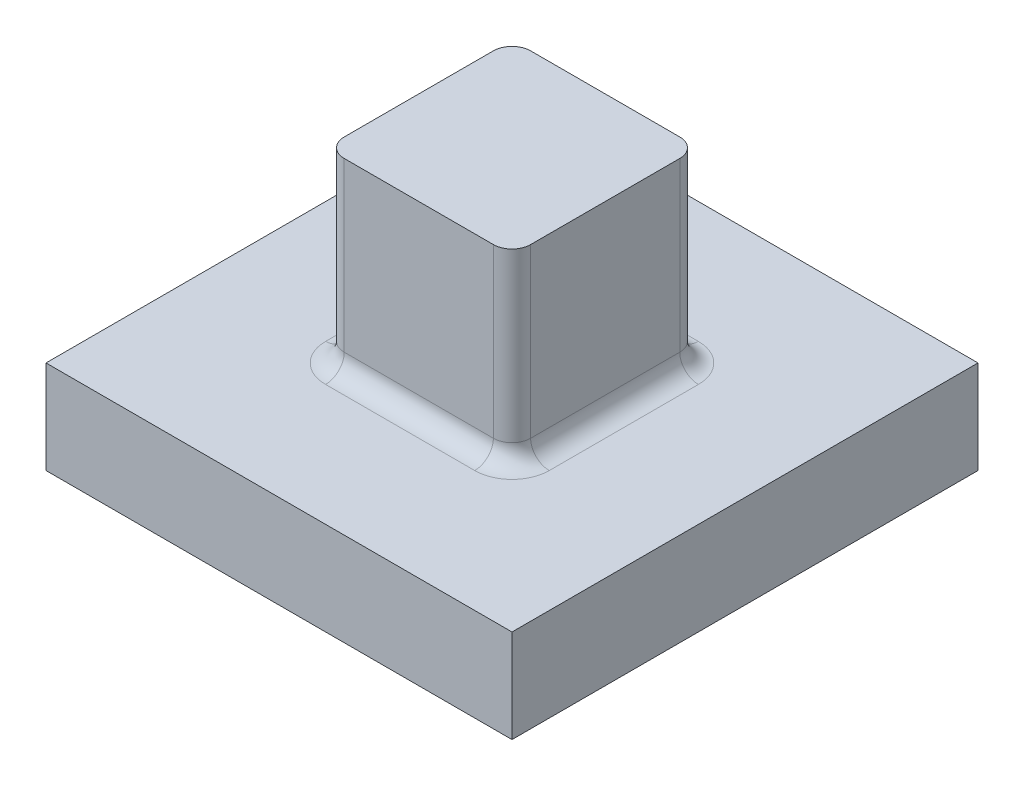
ISO-10303-21;
HEADER;
FILE_DESCRIPTION(('STEP AP214'),'2;1');
FILE_NAME('part.step','',(''),(''),'','','');
FILE_SCHEMA(('AUTOMOTIVE_DESIGN { 1 0 10303 214 1 1 1 1 }'));
ENDSEC;
DATA;
#1=APPLICATION_CONTEXT('core data for automotive mechanical design processes');
#2=APPLICATION_PROTOCOL_DEFINITION('international standard','automotive_design',2000,#1);
#3=PRODUCT_CONTEXT('',#1,'mechanical');
#4=PRODUCT('Part','Part','',(#3));
#5=PRODUCT_RELATED_PRODUCT_CATEGORY('part','',(#4));
#6=PRODUCT_DEFINITION_FORMATION('','',#4);
#7=PRODUCT_DEFINITION_CONTEXT('part definition',#1,'design');
#8=PRODUCT_DEFINITION('design','',#6,#7);
#9=PRODUCT_DEFINITION_SHAPE('','',#8);
#10=(LENGTH_UNIT() NAMED_UNIT(*) SI_UNIT(.MILLI.,.METRE.));
#11=(NAMED_UNIT(*) PLANE_ANGLE_UNIT() SI_UNIT($,.RADIAN.));
#12=(NAMED_UNIT(*) SI_UNIT($,.STERADIAN.) SOLID_ANGLE_UNIT());
#13=UNCERTAINTY_MEASURE_WITH_UNIT(LENGTH_MEASURE(1.E-05),#10,'distance_accuracy_value','');
#14=(GEOMETRIC_REPRESENTATION_CONTEXT(3) GLOBAL_UNCERTAINTY_ASSIGNED_CONTEXT((#13)) GLOBAL_UNIT_ASSIGNED_CONTEXT((#10,
#11,#12)) REPRESENTATION_CONTEXT('',''));
#15=CARTESIAN_POINT('',(0.,0.,0.));
#16=DIRECTION('',(0.,0.,1.));
#17=DIRECTION('',(1.,0.,0.));
#18=AXIS2_PLACEMENT_3D('',#15,#16,#17);
#19=CARTESIAN_POINT('',(0.,30.,0.));
#20=DIRECTION('',(-1.,0.,0.));
#21=DIRECTION('',(0.,0.,1.));
#22=AXIS2_PLACEMENT_3D('',#19,#20,#21);
#23=PLANE('',#22);
#24=DIRECTION('',(0.,0.,-1.));
#25=VECTOR('',#24,1.);
#26=CARTESIAN_POINT('',(0.,10.,0.));
#27=LINE('',#26,#25);
#28=CARTESIAN_POINT('',(0.,10.,0.));
#29=VERTEX_POINT('',#28);
#30=CARTESIAN_POINT('',(0.,10.,-50.));
#31=VERTEX_POINT('',#30);
#32=EDGE_CURVE('E145',#29,#31,#27,.T.);
#33=ORIENTED_EDGE('',*,*,#32,.F.);
#34=DIRECTION('',(0.,-1.,0.));
#35=VECTOR('',#34,1.);
#36=CARTESIAN_POINT('',(0.,30.,0.));
#37=LINE('',#36,#35);
#38=CARTESIAN_POINT('',(0.,0.,0.));
#39=VERTEX_POINT('',#38);
#40=EDGE_CURVE('E158',#29,#39,#37,.T.);
#41=ORIENTED_EDGE('',*,*,#40,.T.);
#42=DIRECTION('',(0.,0.,-1.));
#43=VECTOR('',#42,1.);
#44=CARTESIAN_POINT('',(0.,0.,0.));
#45=LINE('',#44,#43);
#46=CARTESIAN_POINT('',(0.,0.,-50.));
#47=VERTEX_POINT('',#46);
#48=EDGE_CURVE('E160',#39,#47,#45,.T.);
#49=ORIENTED_EDGE('',*,*,#48,.T.);
#50=DIRECTION('',(0.,-1.,0.));
#51=VECTOR('',#50,1.);
#52=CARTESIAN_POINT('',(0.,30.,-50.));
#53=LINE('',#52,#51);
#54=EDGE_CURVE('E153',#31,#47,#53,.T.);
#55=ORIENTED_EDGE('',*,*,#54,.F.);
#56=EDGE_LOOP('',(#33,#41,#49,#55));
#57=FACE_BOUND('',#56,.T.);
#58=ADVANCED_FACE('F34',(#57),#23,.F.);
#59=CARTESIAN_POINT('',(0.,30.,-50.));
#60=DIRECTION('',(0.,0.,1.));
#61=DIRECTION('',(1.,0.,0.));
#62=AXIS2_PLACEMENT_3D('',#59,#60,#61);
#63=PLANE('',#62);
#64=DIRECTION('',(-1.,0.,0.));
#65=VECTOR('',#64,1.);
#66=CARTESIAN_POINT('',(0.,10.,-50.));
#67=LINE('',#66,#65);
#68=CARTESIAN_POINT('',(-50.,10.,-50.));
#69=VERTEX_POINT('',#68);
#70=EDGE_CURVE('E161',#31,#69,#67,.T.);
#71=ORIENTED_EDGE('',*,*,#70,.F.);
#72=ORIENTED_EDGE('',*,*,#54,.T.);
#73=DIRECTION('',(-1.,0.,0.));
#74=VECTOR('',#73,1.);
#75=CARTESIAN_POINT('',(0.,0.,-50.));
#76=LINE('',#75,#74);
#77=CARTESIAN_POINT('',(-50.,0.,-50.));
#78=VERTEX_POINT('',#77);
#79=EDGE_CURVE('E261',#47,#78,#76,.T.);
#80=ORIENTED_EDGE('',*,*,#79,.T.);
#81=DIRECTION('',(0.,-1.,0.));
#82=VECTOR('',#81,1.);
#83=CARTESIAN_POINT('',(-50.,30.,-50.));
#84=LINE('',#83,#82);
#85=EDGE_CURVE('E169',#69,#78,#84,.T.);
#86=ORIENTED_EDGE('',*,*,#85,.F.);
#87=EDGE_LOOP('',(#71,#72,#80,#86));
#88=FACE_BOUND('',#87,.T.);
#89=ADVANCED_FACE('F272',(#88),#63,.F.);
#90=CARTESIAN_POINT('',(-50.,30.,0.));
#91=DIRECTION('',(1.,0.,0.));
#92=DIRECTION('',(0.,0.,-1.));
#93=AXIS2_PLACEMENT_3D('',#90,#91,#92);
#94=PLANE('',#93);
#95=DIRECTION('',(0.,0.,1.));
#96=VECTOR('',#95,1.);
#97=CARTESIAN_POINT('',(-50.,10.,0.));
#98=LINE('',#97,#96);
#99=CARTESIAN_POINT('',(-50.,10.,0.));
#100=VERTEX_POINT('',#99);
#101=EDGE_CURVE('E148',#69,#100,#98,.T.);
#102=ORIENTED_EDGE('',*,*,#101,.F.);
#103=ORIENTED_EDGE('',*,*,#85,.T.);
#104=DIRECTION('',(0.,0.,1.));
#105=VECTOR('',#104,1.);
#106=CARTESIAN_POINT('',(-50.,0.,0.));
#107=LINE('',#106,#105);
#108=CARTESIAN_POINT('',(-50.,0.,0.));
#109=VERTEX_POINT('',#108);
#110=EDGE_CURVE('E171',#78,#109,#107,.T.);
#111=ORIENTED_EDGE('',*,*,#110,.T.);
#112=DIRECTION('',(0.,-1.,0.));
#113=VECTOR('',#112,1.);
#114=CARTESIAN_POINT('',(-50.,30.,0.));
#115=LINE('',#114,#113);
#116=EDGE_CURVE('E167',#100,#109,#115,.T.);
#117=ORIENTED_EDGE('',*,*,#116,.F.);
#118=EDGE_LOOP('',(#102,#103,#111,#117));
#119=FACE_BOUND('',#118,.T.);
#120=ADVANCED_FACE('F266',(#119),#94,.F.);
#121=CARTESIAN_POINT('',(0.,30.,0.));
#122=DIRECTION('',(0.,0.,-1.));
#123=DIRECTION('',(-1.,0.,0.));
#124=AXIS2_PLACEMENT_3D('',#121,#122,#123);
#125=PLANE('',#124);
#126=DIRECTION('',(1.,0.,0.));
#127=VECTOR('',#126,1.);
#128=CARTESIAN_POINT('',(0.,10.,0.));
#129=LINE('',#128,#127);
#130=EDGE_CURVE('E142',#100,#29,#129,.T.);
#131=ORIENTED_EDGE('',*,*,#130,.F.);
#132=ORIENTED_EDGE('',*,*,#116,.T.);
#133=DIRECTION('',(1.,0.,0.));
#134=VECTOR('',#133,1.);
#135=CARTESIAN_POINT('',(0.,0.,0.));
#136=LINE('',#135,#134);
#137=EDGE_CURVE('E165',#109,#39,#136,.T.);
#138=ORIENTED_EDGE('',*,*,#137,.T.);
#139=ORIENTED_EDGE('',*,*,#40,.F.);
#140=EDGE_LOOP('',(#131,#132,#138,#139));
#141=FACE_BOUND('',#140,.T.);
#142=ADVANCED_FACE('F163',(#141),#125,.F.);
#143=CARTESIAN_POINT('',(0.,0.,0.));
#144=DIRECTION('',(0.,1.,0.));
#145=DIRECTION('',(0.,0.,1.));
#146=AXIS2_PLACEMENT_3D('',#143,#144,#145);
#147=PLANE('',#146);
#148=ORIENTED_EDGE('',*,*,#48,.F.);
#149=ORIENTED_EDGE('',*,*,#137,.F.);
#150=ORIENTED_EDGE('',*,*,#110,.F.);
#151=ORIENTED_EDGE('',*,*,#79,.F.);
#152=EDGE_LOOP('',(#148,#149,#150,#151));
#153=FACE_BOUND('',#152,.T.);
#154=ADVANCED_FACE('F270',(#153),#147,.F.);
#155=CARTESIAN_POINT('',(-25.,10.,-25.));
#156=DIRECTION('',(0.,1.,0.));
#157=DIRECTION('',(0.,0.,1.));
#158=AXIS2_PLACEMENT_3D('',#155,#156,#157);
#159=PLANE('',#158);
#160=CARTESIAN_POINT('',(-17.,10.,-17.));
#161=DIRECTION('',(0.,1.,0.));
#162=DIRECTION('',(0.,0.,1.));
#163=AXIS2_PLACEMENT_3D('',#160,#161,#162);
#164=CIRCLE('',#163,4.);
#165=CARTESIAN_POINT('',(-17.,10.,-13.));
#166=VERTEX_POINT('',#165);
#167=CARTESIAN_POINT('',(-13.,10.,-17.));
#168=VERTEX_POINT('',#167);
#169=EDGE_CURVE('E183',#166,#168,#164,.T.);
#170=ORIENTED_EDGE('',*,*,#169,.F.);
#171=DIRECTION('',(1.,0.,0.));
#172=VECTOR('',#171,1.);
#173=CARTESIAN_POINT('',(-35.,10.,-13.));
#174=LINE('',#173,#172);
#175=CARTESIAN_POINT('',(-33.,10.,-13.));
#176=VERTEX_POINT('',#175);
#177=EDGE_CURVE('E201',#166,#176,#174,.F.);
#178=ORIENTED_EDGE('',*,*,#177,.T.);
#179=CARTESIAN_POINT('',(-33.,10.,-17.));
#180=DIRECTION('',(0.,1.,0.));
#181=DIRECTION('',(0.,0.,1.));
#182=AXIS2_PLACEMENT_3D('',#179,#180,#181);
#183=CIRCLE('',#182,4.);
#184=CARTESIAN_POINT('',(-37.,10.,-17.));
#185=VERTEX_POINT('',#184);
#186=EDGE_CURVE('E198',#185,#176,#183,.T.);
#187=ORIENTED_EDGE('',*,*,#186,.F.);
#188=DIRECTION('',(0.,0.,1.));
#189=VECTOR('',#188,1.);
#190=CARTESIAN_POINT('',(-37.,10.,-35.));
#191=LINE('',#190,#189);
#192=CARTESIAN_POINT('',(-37.,10.,-33.));
#193=VERTEX_POINT('',#192);
#194=EDGE_CURVE('E196',#185,#193,#191,.F.);
#195=ORIENTED_EDGE('',*,*,#194,.T.);
#196=CARTESIAN_POINT('',(-33.,10.,-33.));
#197=DIRECTION('',(0.,1.,0.));
#198=DIRECTION('',(0.,0.,1.));
#199=AXIS2_PLACEMENT_3D('',#196,#197,#198);
#200=CIRCLE('',#199,4.);
#201=CARTESIAN_POINT('',(-33.,10.,-37.));
#202=VERTEX_POINT('',#201);
#203=EDGE_CURVE('E193',#202,#193,#200,.T.);
#204=ORIENTED_EDGE('',*,*,#203,.F.);
#205=DIRECTION('',(-1.,0.,0.));
#206=VECTOR('',#205,1.);
#207=CARTESIAN_POINT('',(-15.,10.,-37.));
#208=LINE('',#207,#206);
#209=CARTESIAN_POINT('',(-17.,10.,-37.));
#210=VERTEX_POINT('',#209);
#211=EDGE_CURVE('E191',#202,#210,#208,.F.);
#212=ORIENTED_EDGE('',*,*,#211,.T.);
#213=CARTESIAN_POINT('',(-17.,10.,-33.));
#214=DIRECTION('',(0.,1.,0.));
#215=DIRECTION('',(0.,0.,1.));
#216=AXIS2_PLACEMENT_3D('',#213,#214,#215);
#217=CIRCLE('',#216,4.);
#218=CARTESIAN_POINT('',(-13.,10.,-33.));
#219=VERTEX_POINT('',#218);
#220=EDGE_CURVE('E188',#219,#210,#217,.T.);
#221=ORIENTED_EDGE('',*,*,#220,.F.);
#222=DIRECTION('',(0.,0.,-1.));
#223=VECTOR('',#222,1.);
#224=CARTESIAN_POINT('',(-13.,10.,-15.));
#225=LINE('',#224,#223);
#226=EDGE_CURVE('E186',#219,#168,#225,.F.);
#227=ORIENTED_EDGE('',*,*,#226,.T.);
#228=EDGE_LOOP('',(#170,#178,#187,#195,#204,#212,#221,#227));
#229=FACE_BOUND('',#228,.T.);
#230=ORIENTED_EDGE('',*,*,#32,.T.);
#231=ORIENTED_EDGE('',*,*,#70,.T.);
#232=ORIENTED_EDGE('',*,*,#101,.T.);
#233=ORIENTED_EDGE('',*,*,#130,.T.);
#234=EDGE_LOOP('',(#230,#231,#232,#233));
#235=FACE_BOUND('',#234,.T.);
#236=ADVANCED_FACE('F144',(#229,#235),#159,.T.);
#237=CARTESIAN_POINT('',(-35.,10.,-15.));
#238=DIRECTION('',(0.,0.,1.));
#239=DIRECTION('',(1.,0.,0.));
#240=AXIS2_PLACEMENT_3D('',#237,#238,#239);
#241=PLANE('',#240);
#242=DIRECTION('',(1.,0.,0.));
#243=VECTOR('',#242,1.);
#244=CARTESIAN_POINT('',(-35.,30.,-15.));
#245=LINE('',#244,#243);
#246=CARTESIAN_POINT('',(-33.,30.,-15.));
#247=VERTEX_POINT('',#246);
#248=CARTESIAN_POINT('',(-17.,30.,-15.));
#249=VERTEX_POINT('',#248);
#250=EDGE_CURVE('E390',#247,#249,#245,.T.);
#251=ORIENTED_EDGE('',*,*,#250,.F.);
#252=DIRECTION('',(0.,1.,0.));
#253=VECTOR('',#252,1.);
#254=CARTESIAN_POINT('',(-33.,10.,-15.));
#255=LINE('',#254,#253);
#256=CARTESIAN_POINT('',(-33.,12.,-15.));
#257=VERTEX_POINT('',#256);
#258=EDGE_CURVE('E181',#247,#257,#255,.F.);
#259=ORIENTED_EDGE('',*,*,#258,.T.);
#260=DIRECTION('',(1.,0.,0.));
#261=VECTOR('',#260,1.);
#262=CARTESIAN_POINT('',(-15.,12.,-15.));
#263=LINE('',#262,#261);
#264=CARTESIAN_POINT('',(-17.,12.,-15.));
#265=VERTEX_POINT('',#264);
#266=EDGE_CURVE('E178',#257,#265,#263,.T.);
#267=ORIENTED_EDGE('',*,*,#266,.T.);
#268=DIRECTION('',(0.,1.,0.));
#269=VECTOR('',#268,1.);
#270=CARTESIAN_POINT('',(-17.,10.,-15.));
#271=LINE('',#270,#269);
#272=EDGE_CURVE('E152',#265,#249,#271,.T.);
#273=ORIENTED_EDGE('',*,*,#272,.T.);
#274=EDGE_LOOP('',(#251,#259,#267,#273));
#275=FACE_BOUND('',#274,.T.);
#276=ADVANCED_FACE('F289',(#275),#241,.T.);
#277=CARTESIAN_POINT('',(-35.,10.,-35.));
#278=DIRECTION('',(-1.,0.,0.));
#279=DIRECTION('',(0.,0.,1.));
#280=AXIS2_PLACEMENT_3D('',#277,#278,#279);
#281=PLANE('',#280);
#282=DIRECTION('',(0.,0.,1.));
#283=VECTOR('',#282,1.);
#284=CARTESIAN_POINT('',(-35.,12.,-15.));
#285=LINE('',#284,#283);
#286=CARTESIAN_POINT('',(-35.,12.,-33.));
#287=VERTEX_POINT('',#286);
#288=CARTESIAN_POINT('',(-35.,12.,-17.));
#289=VERTEX_POINT('',#288);
#290=EDGE_CURVE('E206',#287,#289,#285,.T.);
#291=ORIENTED_EDGE('',*,*,#290,.T.);
#292=DIRECTION('',(0.,1.,0.));
#293=VECTOR('',#292,1.);
#294=CARTESIAN_POINT('',(-35.,10.,-17.));
#295=LINE('',#294,#293);
#296=CARTESIAN_POINT('',(-35.,30.,-17.));
#297=VERTEX_POINT('',#296);
#298=EDGE_CURVE('E208',#289,#297,#295,.T.);
#299=ORIENTED_EDGE('',*,*,#298,.T.);
#300=DIRECTION('',(0.,0.,1.));
#301=VECTOR('',#300,1.);
#302=CARTESIAN_POINT('',(-35.,30.,-35.));
#303=LINE('',#302,#301);
#304=CARTESIAN_POINT('',(-35.,30.,-33.));
#305=VERTEX_POINT('',#304);
#306=EDGE_CURVE('E242',#305,#297,#303,.T.);
#307=ORIENTED_EDGE('',*,*,#306,.F.);
#308=DIRECTION('',(0.,1.,0.));
#309=VECTOR('',#308,1.);
#310=CARTESIAN_POINT('',(-35.,10.,-33.));
#311=LINE('',#310,#309);
#312=EDGE_CURVE('E204',#305,#287,#311,.F.);
#313=ORIENTED_EDGE('',*,*,#312,.T.);
#314=EDGE_LOOP('',(#291,#299,#307,#313));
#315=FACE_BOUND('',#314,.T.);
#316=ADVANCED_FACE('F251',(#315),#281,.T.);
#317=CARTESIAN_POINT('',(-15.,10.,-35.));
#318=DIRECTION('',(0.,0.,-1.));
#319=DIRECTION('',(-1.,0.,0.));
#320=AXIS2_PLACEMENT_3D('',#317,#318,#319);
#321=PLANE('',#320);
#322=DIRECTION('',(-1.,0.,0.));
#323=VECTOR('',#322,1.);
#324=CARTESIAN_POINT('',(-35.,12.,-35.));
#325=LINE('',#324,#323);
#326=CARTESIAN_POINT('',(-17.,12.,-35.));
#327=VERTEX_POINT('',#326);
#328=CARTESIAN_POINT('',(-33.,12.,-35.));
#329=VERTEX_POINT('',#328);
#330=EDGE_CURVE('E220',#327,#329,#325,.T.);
#331=ORIENTED_EDGE('',*,*,#330,.T.);
#332=DIRECTION('',(0.,1.,0.));
#333=VECTOR('',#332,1.);
#334=CARTESIAN_POINT('',(-33.,10.,-35.));
#335=LINE('',#334,#333);
#336=CARTESIAN_POINT('',(-33.,30.,-35.));
#337=VERTEX_POINT('',#336);
#338=EDGE_CURVE('E222',#329,#337,#335,.T.);
#339=ORIENTED_EDGE('',*,*,#338,.T.);
#340=DIRECTION('',(-1.,0.,0.));
#341=VECTOR('',#340,1.);
#342=CARTESIAN_POINT('',(-15.,30.,-35.));
#343=LINE('',#342,#341);
#344=CARTESIAN_POINT('',(-17.,30.,-35.));
#345=VERTEX_POINT('',#344);
#346=EDGE_CURVE('E229',#345,#337,#343,.T.);
#347=ORIENTED_EDGE('',*,*,#346,.F.);
#348=DIRECTION('',(0.,1.,0.));
#349=VECTOR('',#348,1.);
#350=CARTESIAN_POINT('',(-17.,10.,-35.));
#351=LINE('',#350,#349);
#352=EDGE_CURVE('E218',#345,#327,#351,.F.);
#353=ORIENTED_EDGE('',*,*,#352,.T.);
#354=EDGE_LOOP('',(#331,#339,#347,#353));
#355=FACE_BOUND('',#354,.T.);
#356=ADVANCED_FACE('F228',(#355),#321,.T.);
#357=CARTESIAN_POINT('',(-15.,10.,-15.));
#358=DIRECTION('',(1.,0.,0.));
#359=DIRECTION('',(0.,0.,-1.));
#360=AXIS2_PLACEMENT_3D('',#357,#358,#359);
#361=PLANE('',#360);
#362=DIRECTION('',(0.,0.,-1.));
#363=VECTOR('',#362,1.);
#364=CARTESIAN_POINT('',(-15.,12.,-35.));
#365=LINE('',#364,#363);
#366=CARTESIAN_POINT('',(-15.,12.,-17.));
#367=VERTEX_POINT('',#366);
#368=CARTESIAN_POINT('',(-15.,12.,-33.));
#369=VERTEX_POINT('',#368);
#370=EDGE_CURVE('E41',#367,#369,#365,.T.);
#371=ORIENTED_EDGE('',*,*,#370,.T.);
#372=DIRECTION('',(0.,1.,0.));
#373=VECTOR('',#372,1.);
#374=CARTESIAN_POINT('',(-15.,10.,-33.));
#375=LINE('',#374,#373);
#376=CARTESIAN_POINT('',(-15.,30.,-33.));
#377=VERTEX_POINT('',#376);
#378=EDGE_CURVE('E12',#369,#377,#375,.T.);
#379=ORIENTED_EDGE('',*,*,#378,.T.);
#380=DIRECTION('',(0.,0.,-1.));
#381=VECTOR('',#380,1.);
#382=CARTESIAN_POINT('',(-15.,30.,-15.));
#383=LINE('',#382,#381);
#384=CARTESIAN_POINT('',(-15.,30.,-17.));
#385=VERTEX_POINT('',#384);
#386=EDGE_CURVE('E243',#385,#377,#383,.T.);
#387=ORIENTED_EDGE('',*,*,#386,.F.);
#388=DIRECTION('',(0.,1.,0.));
#389=VECTOR('',#388,1.);
#390=CARTESIAN_POINT('',(-15.,10.,-17.));
#391=LINE('',#390,#389);
#392=EDGE_CURVE('E51',#385,#367,#391,.F.);
#393=ORIENTED_EDGE('',*,*,#392,.T.);
#394=EDGE_LOOP('',(#371,#379,#387,#393));
#395=FACE_BOUND('',#394,.T.);
#396=ADVANCED_FACE('F284',(#395),#361,.T.);
#397=CARTESIAN_POINT('',(0.,30.,0.));
#398=DIRECTION('',(0.,1.,0.));
#399=DIRECTION('',(0.,0.,1.));
#400=AXIS2_PLACEMENT_3D('',#397,#398,#399);
#401=PLANE('',#400);
#402=ORIENTED_EDGE('',*,*,#306,.T.);
#403=CARTESIAN_POINT('',(-33.,30.,-17.));
#404=DIRECTION('',(0.,1.,0.));
#405=DIRECTION('',(0.,0.,1.));
#406=AXIS2_PLACEMENT_3D('',#403,#404,#405);
#407=CIRCLE('',#406,2.);
#408=EDGE_CURVE('E216',#297,#247,#407,.T.);
#409=ORIENTED_EDGE('',*,*,#408,.T.);
#410=ORIENTED_EDGE('',*,*,#250,.T.);
#411=CARTESIAN_POINT('',(-17.,30.,-17.));
#412=DIRECTION('',(0.,1.,0.));
#413=DIRECTION('',(0.,0.,1.));
#414=AXIS2_PLACEMENT_3D('',#411,#412,#413);
#415=CIRCLE('',#414,2.);
#416=EDGE_CURVE('E210',#249,#385,#415,.T.);
#417=ORIENTED_EDGE('',*,*,#416,.T.);
#418=ORIENTED_EDGE('',*,*,#386,.T.);
#419=CARTESIAN_POINT('',(-17.,30.,-33.));
#420=DIRECTION('',(0.,1.,0.));
#421=DIRECTION('',(0.,0.,1.));
#422=AXIS2_PLACEMENT_3D('',#419,#420,#421);
#423=CIRCLE('',#422,2.);
#424=EDGE_CURVE('E212',#377,#345,#423,.T.);
#425=ORIENTED_EDGE('',*,*,#424,.T.);
#426=ORIENTED_EDGE('',*,*,#346,.T.);
#427=CARTESIAN_POINT('',(-33.,30.,-33.));
#428=DIRECTION('',(0.,1.,0.));
#429=DIRECTION('',(0.,0.,1.));
#430=AXIS2_PLACEMENT_3D('',#427,#428,#429);
#431=CIRCLE('',#430,2.);
#432=EDGE_CURVE('E214',#337,#305,#431,.T.);
#433=ORIENTED_EDGE('',*,*,#432,.T.);
#434=EDGE_LOOP('',(#402,#409,#410,#417,#418,#425,#426,#433));
#435=FACE_BOUND('',#434,.T.);
#436=ADVANCED_FACE('F238',(#435),#401,.T.);
#437=CARTESIAN_POINT('',(-33.,10.,-33.));
#438=DIRECTION('',(0.,1.,0.));
#439=DIRECTION('',(0.,0.,1.));
#440=AXIS2_PLACEMENT_3D('',#437,#438,#439);
#441=CYLINDRICAL_SURFACE('',#440,2.);
#442=ORIENTED_EDGE('',*,*,#432,.F.);
#443=ORIENTED_EDGE('',*,*,#338,.F.);
#444=CARTESIAN_POINT('',(-33.,12.,-33.));
#445=DIRECTION('',(0.,1.,0.));
#446=DIRECTION('',(0.,0.,1.));
#447=AXIS2_PLACEMENT_3D('',#444,#445,#446);
#448=CIRCLE('',#447,2.);
#449=EDGE_CURVE('E248',#287,#329,#448,.F.);
#450=ORIENTED_EDGE('',*,*,#449,.F.);
#451=ORIENTED_EDGE('',*,*,#312,.F.);
#452=EDGE_LOOP('',(#442,#443,#450,#451));
#453=FACE_BOUND('',#452,.T.);
#454=ADVANCED_FACE('F246',(#453),#441,.T.);
#455=CARTESIAN_POINT('',(-17.,10.,-33.));
#456=DIRECTION('',(0.,1.,0.));
#457=DIRECTION('',(0.,0.,1.));
#458=AXIS2_PLACEMENT_3D('',#455,#456,#457);
#459=CYLINDRICAL_SURFACE('',#458,2.);
#460=ORIENTED_EDGE('',*,*,#424,.F.);
#461=ORIENTED_EDGE('',*,*,#378,.F.);
#462=CARTESIAN_POINT('',(-17.,12.,-33.));
#463=DIRECTION('',(0.,1.,0.));
#464=DIRECTION('',(0.,0.,1.));
#465=AXIS2_PLACEMENT_3D('',#462,#463,#464);
#466=CIRCLE('',#465,2.);
#467=EDGE_CURVE('E383',#327,#369,#466,.F.);
#468=ORIENTED_EDGE('',*,*,#467,.F.);
#469=ORIENTED_EDGE('',*,*,#352,.F.);
#470=EDGE_LOOP('',(#460,#461,#468,#469));
#471=FACE_BOUND('',#470,.T.);
#472=ADVANCED_FACE('F302',(#471),#459,.T.);
#473=CARTESIAN_POINT('',(-15.,12.,-37.));
#474=DIRECTION('',(1.,0.,0.));
#475=DIRECTION('',(0.,0.,-1.));
#476=AXIS2_PLACEMENT_3D('',#473,#474,#475);
#477=CYLINDRICAL_SURFACE('',#476,2.);
#478=CARTESIAN_POINT('',(-17.,12.,-37.));
#479=DIRECTION('',(-1.,0.,0.));
#480=DIRECTION('',(0.,0.,1.));
#481=AXIS2_PLACEMENT_3D('',#478,#479,#480);
#482=CIRCLE('',#481,2.);
#483=EDGE_CURVE('E380',#210,#327,#482,.T.);
#484=ORIENTED_EDGE('',*,*,#483,.F.);
#485=ORIENTED_EDGE('',*,*,#211,.F.);
#486=CARTESIAN_POINT('',(-33.,12.,-37.));
#487=DIRECTION('',(1.,0.,0.));
#488=DIRECTION('',(0.,0.,-1.));
#489=AXIS2_PLACEMENT_3D('',#486,#487,#488);
#490=CIRCLE('',#489,2.);
#491=EDGE_CURVE('E387',#329,#202,#490,.T.);
#492=ORIENTED_EDGE('',*,*,#491,.F.);
#493=ORIENTED_EDGE('',*,*,#330,.F.);
#494=EDGE_LOOP('',(#484,#485,#492,#493));
#495=FACE_BOUND('',#494,.T.);
#496=ADVANCED_FACE('F305',(#495),#477,.F.);
#497=CARTESIAN_POINT('',(-33.,12.,-33.));
#498=DIRECTION('',(0.,1.,0.));
#499=DIRECTION('',(0.,0.,1.));
#500=AXIS2_PLACEMENT_3D('',#497,#498,#499);
#501=TOROIDAL_SURFACE('',#500,4.,2.);
#502=ORIENTED_EDGE('',*,*,#491,.T.);
#503=ORIENTED_EDGE('',*,*,#203,.T.);
#504=CARTESIAN_POINT('',(-37.,12.,-33.));
#505=DIRECTION('',(0.,0.,1.));
#506=DIRECTION('',(1.,0.,0.));
#507=AXIS2_PLACEMENT_3D('',#504,#505,#506);
#508=CIRCLE('',#507,2.);
#509=EDGE_CURVE('E377',#287,#193,#508,.F.);
#510=ORIENTED_EDGE('',*,*,#509,.F.);
#511=ORIENTED_EDGE('',*,*,#449,.T.);
#512=EDGE_LOOP('',(#502,#503,#510,#511));
#513=FACE_BOUND('',#512,.T.);
#514=ADVANCED_FACE('F309',(#513),#501,.F.);
#515=CARTESIAN_POINT('',(-17.,12.,-33.));
#516=DIRECTION('',(0.,1.,0.));
#517=DIRECTION('',(0.,0.,1.));
#518=AXIS2_PLACEMENT_3D('',#515,#516,#517);
#519=TOROIDAL_SURFACE('',#518,4.,2.);
#520=ORIENTED_EDGE('',*,*,#483,.T.);
#521=ORIENTED_EDGE('',*,*,#467,.T.);
#522=CARTESIAN_POINT('',(-13.,12.,-33.));
#523=DIRECTION('',(0.,0.,1.));
#524=DIRECTION('',(1.,0.,0.));
#525=AXIS2_PLACEMENT_3D('',#522,#523,#524);
#526=CIRCLE('',#525,2.);
#527=EDGE_CURVE('E374',#219,#369,#526,.F.);
#528=ORIENTED_EDGE('',*,*,#527,.F.);
#529=ORIENTED_EDGE('',*,*,#220,.T.);
#530=EDGE_LOOP('',(#520,#521,#528,#529));
#531=FACE_BOUND('',#530,.T.);
#532=ADVANCED_FACE('F313',(#531),#519,.F.);
#533=CARTESIAN_POINT('',(-37.,12.,-35.));
#534=DIRECTION('',(0.,0.,-1.));
#535=DIRECTION('',(-1.,0.,0.));
#536=AXIS2_PLACEMENT_3D('',#533,#534,#535);
#537=CYLINDRICAL_SURFACE('',#536,2.);
#538=ORIENTED_EDGE('',*,*,#509,.T.);
#539=ORIENTED_EDGE('',*,*,#194,.F.);
#540=CARTESIAN_POINT('',(-37.,12.,-17.));
#541=DIRECTION('',(0.,0.,-1.));
#542=DIRECTION('',(-1.,0.,0.));
#543=AXIS2_PLACEMENT_3D('',#540,#541,#542);
#544=CIRCLE('',#543,2.);
#545=EDGE_CURVE('E358',#289,#185,#544,.T.);
#546=ORIENTED_EDGE('',*,*,#545,.F.);
#547=ORIENTED_EDGE('',*,*,#290,.F.);
#548=EDGE_LOOP('',(#538,#539,#546,#547));
#549=FACE_BOUND('',#548,.T.);
#550=ADVANCED_FACE('F317',(#549),#537,.F.);
#551=CARTESIAN_POINT('',(-33.,10.,-17.));
#552=DIRECTION('',(0.,1.,0.));
#553=DIRECTION('',(0.,0.,1.));
#554=AXIS2_PLACEMENT_3D('',#551,#552,#553);
#555=CYLINDRICAL_SURFACE('',#554,2.);
#556=ORIENTED_EDGE('',*,*,#408,.F.);
#557=ORIENTED_EDGE('',*,*,#298,.F.);
#558=CARTESIAN_POINT('',(-33.,12.,-17.));
#559=DIRECTION('',(0.,1.,0.));
#560=DIRECTION('',(0.,0.,1.));
#561=AXIS2_PLACEMENT_3D('',#558,#559,#560);
#562=CIRCLE('',#561,2.);
#563=EDGE_CURVE('E371',#257,#289,#562,.F.);
#564=ORIENTED_EDGE('',*,*,#563,.F.);
#565=ORIENTED_EDGE('',*,*,#258,.F.);
#566=EDGE_LOOP('',(#556,#557,#564,#565));
#567=FACE_BOUND('',#566,.T.);
#568=ADVANCED_FACE('F321',(#567),#555,.T.);
#569=CARTESIAN_POINT('',(-17.,10.,-17.));
#570=DIRECTION('',(0.,1.,0.));
#571=DIRECTION('',(0.,0.,1.));
#572=AXIS2_PLACEMENT_3D('',#569,#570,#571);
#573=CYLINDRICAL_SURFACE('',#572,2.);
#574=ORIENTED_EDGE('',*,*,#416,.F.);
#575=ORIENTED_EDGE('',*,*,#272,.F.);
#576=CARTESIAN_POINT('',(-17.,12.,-17.));
#577=DIRECTION('',(0.,1.,0.));
#578=DIRECTION('',(0.,0.,1.));
#579=AXIS2_PLACEMENT_3D('',#576,#577,#578);
#580=CIRCLE('',#579,2.);
#581=EDGE_CURVE('E365',#367,#265,#580,.F.);
#582=ORIENTED_EDGE('',*,*,#581,.F.);
#583=ORIENTED_EDGE('',*,*,#392,.F.);
#584=EDGE_LOOP('',(#574,#575,#582,#583));
#585=FACE_BOUND('',#584,.T.);
#586=ADVANCED_FACE('F325',(#585),#573,.T.);
#587=CARTESIAN_POINT('',(-13.,12.,-15.));
#588=DIRECTION('',(0.,0.,1.));
#589=DIRECTION('',(1.,0.,0.));
#590=AXIS2_PLACEMENT_3D('',#587,#588,#589);
#591=CYLINDRICAL_SURFACE('',#590,2.);
#592=ORIENTED_EDGE('',*,*,#527,.T.);
#593=ORIENTED_EDGE('',*,*,#370,.F.);
#594=CARTESIAN_POINT('',(-13.,12.,-17.));
#595=DIRECTION('',(0.,0.,-1.));
#596=DIRECTION('',(-1.,0.,0.));
#597=AXIS2_PLACEMENT_3D('',#594,#595,#596);
#598=CIRCLE('',#597,2.);
#599=EDGE_CURVE('E353',#168,#367,#598,.T.);
#600=ORIENTED_EDGE('',*,*,#599,.F.);
#601=ORIENTED_EDGE('',*,*,#226,.F.);
#602=EDGE_LOOP('',(#592,#593,#600,#601));
#603=FACE_BOUND('',#602,.T.);
#604=ADVANCED_FACE('F329',(#603),#591,.F.);
#605=CARTESIAN_POINT('',(-33.,12.,-17.));
#606=DIRECTION('',(0.,1.,0.));
#607=DIRECTION('',(0.,0.,1.));
#608=AXIS2_PLACEMENT_3D('',#605,#606,#607);
#609=TOROIDAL_SURFACE('',#608,4.,2.);
#610=ORIENTED_EDGE('',*,*,#545,.T.);
#611=ORIENTED_EDGE('',*,*,#186,.T.);
#612=CARTESIAN_POINT('',(-33.,12.,-13.));
#613=DIRECTION('',(1.,0.,0.));
#614=DIRECTION('',(0.,0.,-1.));
#615=AXIS2_PLACEMENT_3D('',#612,#613,#614);
#616=CIRCLE('',#615,2.);
#617=EDGE_CURVE('E350',#257,#176,#616,.F.);
#618=ORIENTED_EDGE('',*,*,#617,.F.);
#619=ORIENTED_EDGE('',*,*,#563,.T.);
#620=EDGE_LOOP('',(#610,#611,#618,#619));
#621=FACE_BOUND('',#620,.T.);
#622=ADVANCED_FACE('F333',(#621),#609,.F.);
#623=CARTESIAN_POINT('',(-17.,12.,-17.));
#624=DIRECTION('',(0.,1.,0.));
#625=DIRECTION('',(0.,0.,1.));
#626=AXIS2_PLACEMENT_3D('',#623,#624,#625);
#627=TOROIDAL_SURFACE('',#626,4.,2.);
#628=ORIENTED_EDGE('',*,*,#599,.T.);
#629=ORIENTED_EDGE('',*,*,#581,.T.);
#630=CARTESIAN_POINT('',(-17.,12.,-13.));
#631=DIRECTION('',(-1.,0.,0.));
#632=DIRECTION('',(0.,0.,1.));
#633=AXIS2_PLACEMENT_3D('',#630,#631,#632);
#634=CIRCLE('',#633,2.);
#635=EDGE_CURVE('E354',#166,#265,#634,.F.);
#636=ORIENTED_EDGE('',*,*,#635,.F.);
#637=ORIENTED_EDGE('',*,*,#169,.T.);
#638=EDGE_LOOP('',(#628,#629,#636,#637));
#639=FACE_BOUND('',#638,.T.);
#640=ADVANCED_FACE('F337',(#639),#627,.F.);
#641=CARTESIAN_POINT('',(-35.,12.,-13.));
#642=DIRECTION('',(-1.,0.,0.));
#643=DIRECTION('',(0.,0.,1.));
#644=AXIS2_PLACEMENT_3D('',#641,#642,#643);
#645=CYLINDRICAL_SURFACE('',#644,2.);
#646=ORIENTED_EDGE('',*,*,#617,.T.);
#647=ORIENTED_EDGE('',*,*,#177,.F.);
#648=ORIENTED_EDGE('',*,*,#635,.T.);
#649=ORIENTED_EDGE('',*,*,#266,.F.);
#650=EDGE_LOOP('',(#646,#647,#648,#649));
#651=FACE_BOUND('',#650,.T.);
#652=ADVANCED_FACE('F341',(#651),#645,.F.);
#653=CLOSED_SHELL('',(#58,#89,#120,#142,#154,#236,#276,#316,#356,#396,#436,#454,#472,#496,#514,
#532,#550,#568,#586,#604,#622,#640,#652));
#654=MANIFOLD_SOLID_BREP('B2',#653);
#655=ADVANCED_BREP_SHAPE_REPRESENTATION('',(#18,#654),#14);
#656=SHAPE_DEFINITION_REPRESENTATION(#9,#655);
ENDSEC;
END-ISO-10303-21;
